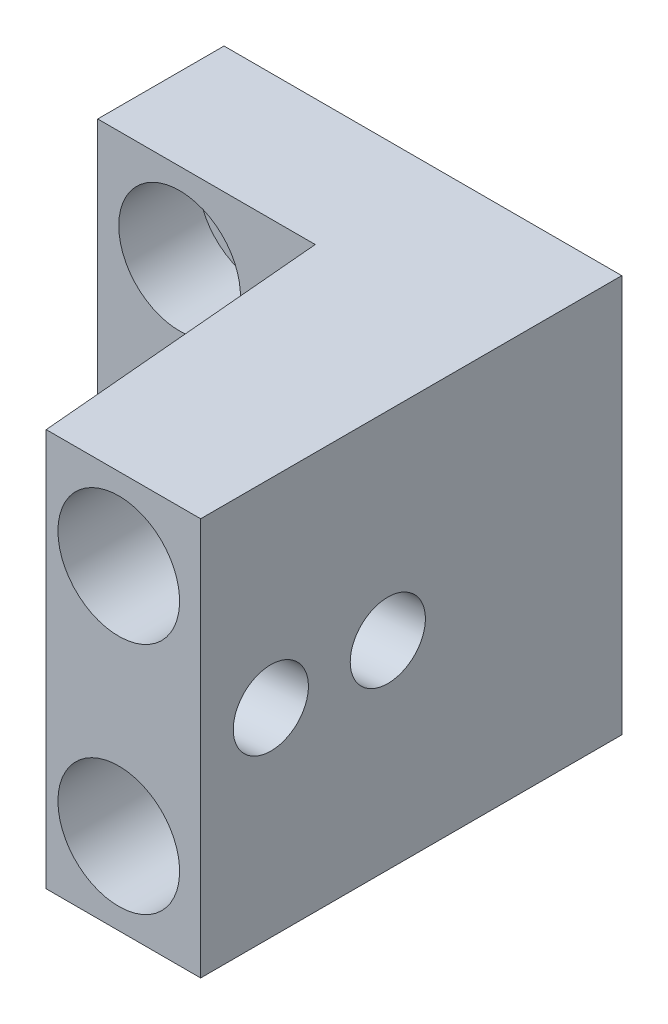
ISO-10303-21;
HEADER;
FILE_DESCRIPTION(('STEP AP214'),'2;1');
FILE_NAME('part.step','',(''),(''),'','','');
FILE_SCHEMA(('AUTOMOTIVE_DESIGN { 1 0 10303 214 1 1 1 1 }'));
ENDSEC;
DATA;
#1=APPLICATION_CONTEXT('core data for automotive mechanical design processes');
#2=APPLICATION_PROTOCOL_DEFINITION('international standard','automotive_design',2000,#1);
#3=PRODUCT_CONTEXT('',#1,'mechanical');
#4=PRODUCT('Part','Part','',(#3));
#5=PRODUCT_RELATED_PRODUCT_CATEGORY('part','',(#4));
#6=PRODUCT_DEFINITION_FORMATION('','',#4);
#7=PRODUCT_DEFINITION_CONTEXT('part definition',#1,'design');
#8=PRODUCT_DEFINITION('design','',#6,#7);
#9=PRODUCT_DEFINITION_SHAPE('','',#8);
#10=(LENGTH_UNIT() NAMED_UNIT(*) SI_UNIT(.MILLI.,.METRE.));
#11=(NAMED_UNIT(*) PLANE_ANGLE_UNIT() SI_UNIT($,.RADIAN.));
#12=(NAMED_UNIT(*) SI_UNIT($,.STERADIAN.) SOLID_ANGLE_UNIT());
#13=UNCERTAINTY_MEASURE_WITH_UNIT(LENGTH_MEASURE(1.E-05),#10,'distance_accuracy_value','');
#14=(GEOMETRIC_REPRESENTATION_CONTEXT(3) GLOBAL_UNCERTAINTY_ASSIGNED_CONTEXT((#13)) GLOBAL_UNIT_ASSIGNED_CONTEXT((#10,
#11,#12)) REPRESENTATION_CONTEXT('',''));
#15=CARTESIAN_POINT('',(0.,0.,0.));
#16=DIRECTION('',(0.,0.,1.));
#17=DIRECTION('',(1.,0.,0.));
#18=AXIS2_PLACEMENT_3D('',#15,#16,#17);
#19=CARTESIAN_POINT('',(-17.5,-17.5,27.));
#20=DIRECTION('',(0.,0.,1.));
#21=DIRECTION('',(-1.,0.,0.));
#22=AXIS2_PLACEMENT_3D('',#19,#20,#21);
#23=PLANE('',#22);
#24=CARTESIAN_POINT('',(0.,50.,27.));
#25=DIRECTION('',(0.,0.,1.));
#26=DIRECTION('',(-1.,0.,0.));
#27=AXIS2_PLACEMENT_3D('',#24,#25,#26);
#28=CIRCLE('',#27,13.);
#29=CARTESIAN_POINT('',(-13.,50.,27.));
#30=VERTEX_POINT('',#29);
#31=EDGE_CURVE('E147',#30,#30,#28,.T.);
#32=ORIENTED_EDGE('',*,*,#31,.F.);
#33=EDGE_LOOP('',(#32));
#34=FACE_BOUND('',#33,.T.);
#35=DIRECTION('',(1.,0.,0.));
#36=VECTOR('',#35,1.);
#37=CARTESIAN_POINT('',(-17.5,-17.5,27.));
#38=LINE('',#37,#36);
#39=CARTESIAN_POINT('',(-17.5,-17.5,27.));
#40=VERTEX_POINT('',#39);
#41=CARTESIAN_POINT('',(28.9882141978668,-17.5,27.));
#42=VERTEX_POINT('',#41);
#43=EDGE_CURVE('E104',#40,#42,#38,.T.);
#44=ORIENTED_EDGE('',*,*,#43,.T.);
#45=DIRECTION('',(0.,1.,0.));
#46=VECTOR('',#45,1.);
#47=CARTESIAN_POINT('',(28.9882141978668,-17.5,27.));
#48=LINE('',#47,#46);
#49=CARTESIAN_POINT('',(28.9882141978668,67.5,27.));
#50=VERTEX_POINT('',#49);
#51=EDGE_CURVE('E75',#42,#50,#48,.T.);
#52=ORIENTED_EDGE('',*,*,#51,.T.);
#53=DIRECTION('',(1.,0.,0.));
#54=VECTOR('',#53,1.);
#55=CARTESIAN_POINT('',(-17.5,67.5,27.));
#56=LINE('',#55,#54);
#57=CARTESIAN_POINT('',(-17.5,67.5,27.));
#58=VERTEX_POINT('',#57);
#59=EDGE_CURVE('E82',#58,#50,#56,.T.);
#60=ORIENTED_EDGE('',*,*,#59,.F.);
#61=DIRECTION('',(0.,1.,0.));
#62=VECTOR('',#61,1.);
#63=CARTESIAN_POINT('',(-17.5,-17.5,27.));
#64=LINE('',#63,#62);
#65=EDGE_CURVE('E65',#40,#58,#64,.T.);
#66=ORIENTED_EDGE('',*,*,#65,.F.);
#67=EDGE_LOOP('',(#44,#52,#60,#66));
#68=FACE_BOUND('',#67,.T.);
#69=CARTESIAN_POINT('',(0.,0.,27.));
#70=DIRECTION('',(0.,0.,1.));
#71=DIRECTION('',(-1.,0.,0.));
#72=AXIS2_PLACEMENT_3D('',#69,#70,#71);
#73=CIRCLE('',#72,13.);
#74=CARTESIAN_POINT('',(-13.,0.,27.));
#75=VERTEX_POINT('',#74);
#76=EDGE_CURVE('E135',#75,#75,#73,.T.);
#77=ORIENTED_EDGE('',*,*,#76,.F.);
#78=EDGE_LOOP('',(#77));
#79=FACE_BOUND('',#78,.T.);
#80=ADVANCED_FACE('F14',(#34,#68,#79),#23,.T.);
#81=CARTESIAN_POINT('',(67.5,-17.5,0.));
#82=DIRECTION('',(0.,0.,-1.));
#83=DIRECTION('',(1.,0.,0.));
#84=AXIS2_PLACEMENT_3D('',#81,#82,#83);
#85=PLANE('',#84);
#86=CARTESIAN_POINT('',(0.,50.,0.));
#87=DIRECTION('',(0.,0.,1.));
#88=DIRECTION('',(-1.,0.,0.));
#89=AXIS2_PLACEMENT_3D('',#86,#87,#88);
#90=CIRCLE('',#89,9.);
#91=CARTESIAN_POINT('',(-9.,50.,0.));
#92=VERTEX_POINT('',#91);
#93=EDGE_CURVE('E138',#92,#92,#90,.T.);
#94=ORIENTED_EDGE('',*,*,#93,.T.);
#95=EDGE_LOOP('',(#94));
#96=FACE_BOUND('',#95,.T.);
#97=CARTESIAN_POINT('',(50.,50.,0.));
#98=DIRECTION('',(0.,0.,1.));
#99=DIRECTION('',(-1.,0.,0.));
#100=AXIS2_PLACEMENT_3D('',#97,#98,#99);
#101=CIRCLE('',#100,9.);
#102=CARTESIAN_POINT('',(41.,50.,0.));
#103=VERTEX_POINT('',#102);
#104=EDGE_CURVE('E86',#103,#103,#101,.T.);
#105=ORIENTED_EDGE('',*,*,#104,.T.);
#106=EDGE_LOOP('',(#105));
#107=FACE_BOUND('',#106,.T.);
#108=DIRECTION('',(0.,1.,0.));
#109=VECTOR('',#108,1.);
#110=CARTESIAN_POINT('',(67.5,-17.5,0.));
#111=LINE('',#110,#109);
#112=CARTESIAN_POINT('',(67.5,-17.5,0.));
#113=VERTEX_POINT('',#112);
#114=CARTESIAN_POINT('',(67.5,67.5,0.));
#115=VERTEX_POINT('',#114);
#116=EDGE_CURVE('E23',#113,#115,#111,.T.);
#117=ORIENTED_EDGE('',*,*,#116,.F.);
#118=DIRECTION('',(-1.,0.,0.));
#119=VECTOR('',#118,1.);
#120=CARTESIAN_POINT('',(67.5,-17.5,0.));
#121=LINE('',#120,#119);
#122=CARTESIAN_POINT('',(-17.5,-17.5,0.));
#123=VERTEX_POINT('',#122);
#124=EDGE_CURVE('E76',#113,#123,#121,.T.);
#125=ORIENTED_EDGE('',*,*,#124,.T.);
#126=DIRECTION('',(0.,1.,0.));
#127=VECTOR('',#126,1.);
#128=CARTESIAN_POINT('',(-17.5,-17.5,0.));
#129=LINE('',#128,#127);
#130=CARTESIAN_POINT('',(-17.5,67.5,0.));
#131=VERTEX_POINT('',#130);
#132=EDGE_CURVE('E9',#123,#131,#129,.T.);
#133=ORIENTED_EDGE('',*,*,#132,.T.);
#134=DIRECTION('',(-1.,0.,0.));
#135=VECTOR('',#134,1.);
#136=CARTESIAN_POINT('',(67.5,67.5,0.));
#137=LINE('',#136,#135);
#138=EDGE_CURVE('E85',#115,#131,#137,.T.);
#139=ORIENTED_EDGE('',*,*,#138,.F.);
#140=EDGE_LOOP('',(#117,#125,#133,#139));
#141=FACE_BOUND('',#140,.T.);
#142=CARTESIAN_POINT('',(50.,0.,0.));
#143=DIRECTION('',(0.,0.,1.));
#144=DIRECTION('',(-1.,0.,0.));
#145=AXIS2_PLACEMENT_3D('',#142,#143,#144);
#146=CIRCLE('',#145,9.);
#147=CARTESIAN_POINT('',(41.,0.,0.));
#148=VERTEX_POINT('',#147);
#149=EDGE_CURVE('E159',#148,#148,#146,.T.);
#150=ORIENTED_EDGE('',*,*,#149,.T.);
#151=EDGE_LOOP('',(#150));
#152=FACE_BOUND('',#151,.T.);
#153=CARTESIAN_POINT('',(0.,0.,0.));
#154=DIRECTION('',(0.,0.,1.));
#155=DIRECTION('',(-1.,0.,0.));
#156=AXIS2_PLACEMENT_3D('',#153,#154,#155);
#157=CIRCLE('',#156,9.);
#158=CARTESIAN_POINT('',(-9.,0.,0.));
#159=VERTEX_POINT('',#158);
#160=EDGE_CURVE('E119',#159,#159,#157,.T.);
#161=ORIENTED_EDGE('',*,*,#160,.T.);
#162=EDGE_LOOP('',(#161));
#163=FACE_BOUND('',#162,.T.);
#164=ADVANCED_FACE('F16',(#96,#107,#141,#152,#163),#85,.T.);
#165=CARTESIAN_POINT('',(34.5,-17.5,90.));
#166=DIRECTION('',(0.,0.,1.));
#167=DIRECTION('',(-1.,0.,0.));
#168=AXIS2_PLACEMENT_3D('',#165,#166,#167);
#169=PLANE('',#168);
#170=CARTESIAN_POINT('',(50.,50.,90.));
#171=DIRECTION('',(0.,0.,1.));
#172=DIRECTION('',(-1.,0.,0.));
#173=AXIS2_PLACEMENT_3D('',#170,#171,#172);
#174=CIRCLE('',#173,13.);
#175=CARTESIAN_POINT('',(37.,50.,90.));
#176=VERTEX_POINT('',#175);
#177=EDGE_CURVE('E162',#176,#176,#174,.T.);
#178=ORIENTED_EDGE('',*,*,#177,.F.);
#179=EDGE_LOOP('',(#178));
#180=FACE_BOUND('',#179,.T.);
#181=DIRECTION('',(0.,1.,0.));
#182=VECTOR('',#181,1.);
#183=CARTESIAN_POINT('',(34.5,-17.5,90.));
#184=LINE('',#183,#182);
#185=CARTESIAN_POINT('',(34.5,-17.5,90.));
#186=VERTEX_POINT('',#185);
#187=CARTESIAN_POINT('',(34.5,67.5,90.));
#188=VERTEX_POINT('',#187);
#189=EDGE_CURVE('E108',#186,#188,#184,.T.);
#190=ORIENTED_EDGE('',*,*,#189,.F.);
#191=DIRECTION('',(1.,0.,0.));
#192=VECTOR('',#191,1.);
#193=CARTESIAN_POINT('',(34.5,-17.5,90.));
#194=LINE('',#193,#192);
#195=CARTESIAN_POINT('',(67.5,-17.5,90.));
#196=VERTEX_POINT('',#195);
#197=EDGE_CURVE('E98',#186,#196,#194,.T.);
#198=ORIENTED_EDGE('',*,*,#197,.T.);
#199=DIRECTION('',(0.,1.,0.));
#200=VECTOR('',#199,1.);
#201=CARTESIAN_POINT('',(67.5,-17.5,90.));
#202=LINE('',#201,#200);
#203=CARTESIAN_POINT('',(67.5,67.5,90.));
#204=VERTEX_POINT('',#203);
#205=EDGE_CURVE('E110',#196,#204,#202,.T.);
#206=ORIENTED_EDGE('',*,*,#205,.T.);
#207=DIRECTION('',(1.,0.,0.));
#208=VECTOR('',#207,1.);
#209=CARTESIAN_POINT('',(34.5,67.5,90.));
#210=LINE('',#209,#208);
#211=EDGE_CURVE('E91',#188,#204,#210,.T.);
#212=ORIENTED_EDGE('',*,*,#211,.F.);
#213=EDGE_LOOP('',(#190,#198,#206,#212));
#214=FACE_BOUND('',#213,.T.);
#215=CARTESIAN_POINT('',(50.,0.,90.));
#216=DIRECTION('',(0.,0.,1.));
#217=DIRECTION('',(-1.,0.,0.));
#218=AXIS2_PLACEMENT_3D('',#215,#216,#217);
#219=CIRCLE('',#218,13.);
#220=CARTESIAN_POINT('',(37.,0.,90.));
#221=VERTEX_POINT('',#220);
#222=EDGE_CURVE('E150',#221,#221,#219,.T.);
#223=ORIENTED_EDGE('',*,*,#222,.F.);
#224=EDGE_LOOP('',(#223));
#225=FACE_BOUND('',#224,.T.);
#226=ADVANCED_FACE('F188',(#180,#214,#225),#169,.T.);
#227=CARTESIAN_POINT('',(-17.5,67.5,0.));
#228=DIRECTION('',(0.,-1.,0.));
#229=DIRECTION('',(0.,0.,1.));
#230=AXIS2_PLACEMENT_3D('',#227,#228,#229);
#231=PLANE('',#230);
#232=DIRECTION('',(0.,0.,1.));
#233=VECTOR('',#232,1.);
#234=CARTESIAN_POINT('',(-17.5,67.5,0.));
#235=LINE('',#234,#233);
#236=EDGE_CURVE('E68',#131,#58,#235,.T.);
#237=ORIENTED_EDGE('',*,*,#236,.T.);
#238=ORIENTED_EDGE('',*,*,#59,.T.);
#239=DIRECTION('',(-0.0871557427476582,0.,-0.996194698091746));
#240=VECTOR('',#239,1.);
#241=CARTESIAN_POINT('',(34.5,67.5,90.));
#242=LINE('',#241,#240);
#243=EDGE_CURVE('E89',#188,#50,#242,.T.);
#244=ORIENTED_EDGE('',*,*,#243,.F.);
#245=ORIENTED_EDGE('',*,*,#211,.T.);
#246=DIRECTION('',(0.,0.,-1.));
#247=VECTOR('',#246,1.);
#248=CARTESIAN_POINT('',(67.5,67.5,90.));
#249=LINE('',#248,#247);
#250=EDGE_CURVE('E174',#204,#115,#249,.T.);
#251=ORIENTED_EDGE('',*,*,#250,.T.);
#252=ORIENTED_EDGE('',*,*,#138,.T.);
#253=EDGE_LOOP('',(#237,#238,#244,#245,#251,#252));
#254=FACE_BOUND('',#253,.T.);
#255=ADVANCED_FACE('F80',(#254),#231,.F.);
#256=CARTESIAN_POINT('',(-17.5,-17.5,0.));
#257=DIRECTION('',(-1.,0.,0.));
#258=DIRECTION('',(0.,0.,-1.));
#259=AXIS2_PLACEMENT_3D('',#256,#257,#258);
#260=PLANE('',#259);
#261=ORIENTED_EDGE('',*,*,#132,.F.);
#262=DIRECTION('',(0.,0.,1.));
#263=VECTOR('',#262,1.);
#264=CARTESIAN_POINT('',(-17.5,-17.5,0.));
#265=LINE('',#264,#263);
#266=EDGE_CURVE('E70',#123,#40,#265,.T.);
#267=ORIENTED_EDGE('',*,*,#266,.T.);
#268=ORIENTED_EDGE('',*,*,#65,.T.);
#269=ORIENTED_EDGE('',*,*,#236,.F.);
#270=EDGE_LOOP('',(#261,#267,#268,#269));
#271=FACE_BOUND('',#270,.T.);
#272=ADVANCED_FACE('F67',(#271),#260,.T.);
#273=CARTESIAN_POINT('',(67.5,-17.5,90.));
#274=DIRECTION('',(1.,0.,0.));
#275=DIRECTION('',(0.,0.,1.));
#276=AXIS2_PLACEMENT_3D('',#273,#274,#275);
#277=PLANE('',#276);
#278=CARTESIAN_POINT('',(67.5,25.,50.));
#279=DIRECTION('',(1.,0.,0.));
#280=DIRECTION('',(0.,0.,1.));
#281=AXIS2_PLACEMENT_3D('',#278,#279,#280);
#282=ELLIPSE('',#281,8.03055870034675,8.);
#283=CARTESIAN_POINT('',(67.5,25.,58.0305587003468));
#284=VERTEX_POINT('',#283);
#285=EDGE_CURVE('E115',#284,#284,#282,.T.);
#286=ORIENTED_EDGE('',*,*,#285,.F.);
#287=EDGE_LOOP('',(#286));
#288=FACE_BOUND('',#287,.T.);
#289=CARTESIAN_POINT('',(67.5,25.,75.));
#290=DIRECTION('',(1.,0.,0.));
#291=DIRECTION('',(0.,0.,1.));
#292=AXIS2_PLACEMENT_3D('',#289,#290,#291);
#293=ELLIPSE('',#292,8.03055870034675,8.);
#294=CARTESIAN_POINT('',(67.5,25.,83.0305587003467));
#295=VERTEX_POINT('',#294);
#296=EDGE_CURVE('E114',#295,#295,#293,.T.);
#297=ORIENTED_EDGE('',*,*,#296,.F.);
#298=EDGE_LOOP('',(#297));
#299=FACE_BOUND('',#298,.T.);
#300=ORIENTED_EDGE('',*,*,#205,.F.);
#301=DIRECTION('',(0.,0.,-1.));
#302=VECTOR('',#301,1.);
#303=CARTESIAN_POINT('',(67.5,-17.5,90.));
#304=LINE('',#303,#302);
#305=EDGE_CURVE('E96',#196,#113,#304,.T.);
#306=ORIENTED_EDGE('',*,*,#305,.T.);
#307=ORIENTED_EDGE('',*,*,#116,.T.);
#308=ORIENTED_EDGE('',*,*,#250,.F.);
#309=EDGE_LOOP('',(#300,#306,#307,#308));
#310=FACE_BOUND('',#309,.T.);
#311=ADVANCED_FACE('F180',(#288,#299,#310),#277,.T.);
#312=CARTESIAN_POINT('',(34.5,-17.5,90.));
#313=DIRECTION('',(0.996194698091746,0.,-0.0871557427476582));
#314=DIRECTION('',(0.0871557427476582,0.,0.996194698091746));
#315=AXIS2_PLACEMENT_3D('',#312,#313,#314);
#316=PLANE('',#315);
#317=CARTESIAN_POINT('',(31.2777085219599,25.,53.1690398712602));
#318=DIRECTION('',(0.996194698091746,0.,-0.0871557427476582));
#319=DIRECTION('',(0.0871557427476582,0.,0.996194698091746));
#320=AXIS2_PLACEMENT_3D('',#317,#318,#319);
#321=CIRCLE('',#320,8.);
#322=CARTESIAN_POINT('',(31.9749544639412,25.,61.1385974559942));
#323=VERTEX_POINT('',#322);
#324=EDGE_CURVE('E18',#323,#323,#321,.T.);
#325=ORIENTED_EDGE('',*,*,#324,.T.);
#326=EDGE_LOOP('',(#325));
#327=FACE_BOUND('',#326,.T.);
#328=CARTESIAN_POINT('',(33.4483107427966,25.,77.9791367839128));
#329=DIRECTION('',(0.996194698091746,0.,-0.0871557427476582));
#330=DIRECTION('',(0.0871557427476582,0.,0.996194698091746));
#331=AXIS2_PLACEMENT_3D('',#328,#329,#330);
#332=CIRCLE('',#331,8.);
#333=CARTESIAN_POINT('',(34.1455566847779,25.,85.9486943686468));
#334=VERTEX_POINT('',#333);
#335=EDGE_CURVE('E112',#334,#334,#332,.T.);
#336=ORIENTED_EDGE('',*,*,#335,.T.);
#337=EDGE_LOOP('',(#336));
#338=FACE_BOUND('',#337,.T.);
#339=ORIENTED_EDGE('',*,*,#51,.F.);
#340=DIRECTION('',(-0.0871557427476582,0.,-0.996194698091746));
#341=VECTOR('',#340,1.);
#342=CARTESIAN_POINT('',(34.5,-17.5,90.));
#343=LINE('',#342,#341);
#344=EDGE_CURVE('E101',#186,#42,#343,.T.);
#345=ORIENTED_EDGE('',*,*,#344,.F.);
#346=ORIENTED_EDGE('',*,*,#189,.T.);
#347=ORIENTED_EDGE('',*,*,#243,.T.);
#348=EDGE_LOOP('',(#339,#345,#346,#347));
#349=FACE_BOUND('',#348,.T.);
#350=ADVANCED_FACE('F222',(#327,#338,#349),#316,.F.);
#351=CARTESIAN_POINT('',(-17.5,-17.5,0.));
#352=DIRECTION('',(0.,-1.,0.));
#353=DIRECTION('',(0.,0.,1.));
#354=AXIS2_PLACEMENT_3D('',#351,#352,#353);
#355=PLANE('',#354);
#356=ORIENTED_EDGE('',*,*,#266,.F.);
#357=ORIENTED_EDGE('',*,*,#124,.F.);
#358=ORIENTED_EDGE('',*,*,#305,.F.);
#359=ORIENTED_EDGE('',*,*,#197,.F.);
#360=ORIENTED_EDGE('',*,*,#344,.T.);
#361=ORIENTED_EDGE('',*,*,#43,.F.);
#362=EDGE_LOOP('',(#356,#357,#358,#359,#360,#361));
#363=FACE_BOUND('',#362,.T.);
#364=ADVANCED_FACE('F185',(#363),#355,.T.);
#365=CARTESIAN_POINT('',(50.,50.,90.));
#366=DIRECTION('',(0.,0.,1.));
#367=DIRECTION('',(-1.,0.,0.));
#368=AXIS2_PLACEMENT_3D('',#365,#366,#367);
#369=CYLINDRICAL_SURFACE('',#368,9.);
#370=CARTESIAN_POINT('',(50.,50.,33.));
#371=DIRECTION('',(0.,0.,1.));
#372=DIRECTION('',(-1.,0.,0.));
#373=AXIS2_PLACEMENT_3D('',#370,#371,#372);
#374=CIRCLE('',#373,9.);
#375=CARTESIAN_POINT('',(41.,50.,33.));
#376=VERTEX_POINT('',#375);
#377=EDGE_CURVE('E168',#376,#376,#374,.T.);
#378=ORIENTED_EDGE('',*,*,#377,.T.);
#379=EDGE_LOOP('',(#378));
#380=FACE_BOUND('',#379,.T.);
#381=ORIENTED_EDGE('',*,*,#104,.F.);
#382=EDGE_LOOP('',(#381));
#383=FACE_BOUND('',#382,.T.);
#384=ADVANCED_FACE('F246',(#380,#383),#369,.F.);
#385=CARTESIAN_POINT('',(41.,50.,33.));
#386=DIRECTION('',(0.,0.,1.));
#387=DIRECTION('',(-1.,0.,0.));
#388=AXIS2_PLACEMENT_3D('',#385,#386,#387);
#389=PLANE('',#388);
#390=CARTESIAN_POINT('',(50.,50.,33.));
#391=DIRECTION('',(0.,0.,1.));
#392=DIRECTION('',(-1.,0.,0.));
#393=AXIS2_PLACEMENT_3D('',#390,#391,#392);
#394=CIRCLE('',#393,13.);
#395=CARTESIAN_POINT('',(37.,50.,33.));
#396=VERTEX_POINT('',#395);
#397=EDGE_CURVE('E165',#396,#396,#394,.T.);
#398=ORIENTED_EDGE('',*,*,#397,.T.);
#399=EDGE_LOOP('',(#398));
#400=FACE_BOUND('',#399,.T.);
#401=ORIENTED_EDGE('',*,*,#377,.F.);
#402=EDGE_LOOP('',(#401));
#403=FACE_BOUND('',#402,.T.);
#404=ADVANCED_FACE('F253',(#400,#403),#389,.T.);
#405=CARTESIAN_POINT('',(50.,50.,90.));
#406=DIRECTION('',(0.,0.,1.));
#407=DIRECTION('',(-1.,0.,0.));
#408=AXIS2_PLACEMENT_3D('',#405,#406,#407);
#409=CYLINDRICAL_SURFACE('',#408,13.);
#410=ORIENTED_EDGE('',*,*,#177,.T.);
#411=EDGE_LOOP('',(#410));
#412=FACE_BOUND('',#411,.T.);
#413=ORIENTED_EDGE('',*,*,#397,.F.);
#414=EDGE_LOOP('',(#413));
#415=FACE_BOUND('',#414,.T.);
#416=ADVANCED_FACE('F259',(#412,#415),#409,.F.);
#417=CARTESIAN_POINT('',(50.,0.,90.));
#418=DIRECTION('',(0.,0.,1.));
#419=DIRECTION('',(-1.,0.,0.));
#420=AXIS2_PLACEMENT_3D('',#417,#418,#419);
#421=CYLINDRICAL_SURFACE('',#420,9.);
#422=CARTESIAN_POINT('',(50.,0.,33.));
#423=DIRECTION('',(0.,0.,1.));
#424=DIRECTION('',(-1.,0.,0.));
#425=AXIS2_PLACEMENT_3D('',#422,#423,#424);
#426=CIRCLE('',#425,9.);
#427=CARTESIAN_POINT('',(41.,0.,33.));
#428=VERTEX_POINT('',#427);
#429=EDGE_CURVE('E156',#428,#428,#426,.T.);
#430=ORIENTED_EDGE('',*,*,#429,.T.);
#431=EDGE_LOOP('',(#430));
#432=FACE_BOUND('',#431,.T.);
#433=ORIENTED_EDGE('',*,*,#149,.F.);
#434=EDGE_LOOP('',(#433));
#435=FACE_BOUND('',#434,.T.);
#436=ADVANCED_FACE('F270',(#432,#435),#421,.F.);
#437=CARTESIAN_POINT('',(41.,0.,33.));
#438=DIRECTION('',(0.,0.,1.));
#439=DIRECTION('',(-1.,0.,0.));
#440=AXIS2_PLACEMENT_3D('',#437,#438,#439);
#441=PLANE('',#440);
#442=CARTESIAN_POINT('',(50.,0.,33.));
#443=DIRECTION('',(0.,0.,1.));
#444=DIRECTION('',(-1.,0.,0.));
#445=AXIS2_PLACEMENT_3D('',#442,#443,#444);
#446=CIRCLE('',#445,13.);
#447=CARTESIAN_POINT('',(37.,0.,33.));
#448=VERTEX_POINT('',#447);
#449=EDGE_CURVE('E153',#448,#448,#446,.T.);
#450=ORIENTED_EDGE('',*,*,#449,.T.);
#451=EDGE_LOOP('',(#450));
#452=FACE_BOUND('',#451,.T.);
#453=ORIENTED_EDGE('',*,*,#429,.F.);
#454=EDGE_LOOP('',(#453));
#455=FACE_BOUND('',#454,.T.);
#456=ADVANCED_FACE('F276',(#452,#455),#441,.T.);
#457=CARTESIAN_POINT('',(50.,0.,90.));
#458=DIRECTION('',(0.,0.,1.));
#459=DIRECTION('',(-1.,0.,0.));
#460=AXIS2_PLACEMENT_3D('',#457,#458,#459);
#461=CYLINDRICAL_SURFACE('',#460,13.);
#462=ORIENTED_EDGE('',*,*,#222,.T.);
#463=EDGE_LOOP('',(#462));
#464=FACE_BOUND('',#463,.T.);
#465=ORIENTED_EDGE('',*,*,#449,.F.);
#466=EDGE_LOOP('',(#465));
#467=FACE_BOUND('',#466,.T.);
#468=ADVANCED_FACE('F280',(#464,#467),#461,.F.);
#469=CARTESIAN_POINT('',(0.,50.,27.));
#470=DIRECTION('',(0.,0.,1.));
#471=DIRECTION('',(-1.,0.,0.));
#472=AXIS2_PLACEMENT_3D('',#469,#470,#471);
#473=CYLINDRICAL_SURFACE('',#472,13.);
#474=ORIENTED_EDGE('',*,*,#31,.T.);
#475=EDGE_LOOP('',(#474));
#476=FACE_BOUND('',#475,.T.);
#477=CARTESIAN_POINT('',(0.,50.,10.));
#478=DIRECTION('',(0.,0.,1.));
#479=DIRECTION('',(-1.,0.,0.));
#480=AXIS2_PLACEMENT_3D('',#477,#478,#479);
#481=CIRCLE('',#480,13.);
#482=CARTESIAN_POINT('',(-13.,50.,10.));
#483=VERTEX_POINT('',#482);
#484=EDGE_CURVE('E144',#483,#483,#481,.T.);
#485=ORIENTED_EDGE('',*,*,#484,.F.);
#486=EDGE_LOOP('',(#485));
#487=FACE_BOUND('',#486,.T.);
#488=ADVANCED_FACE('F284',(#476,#487),#473,.F.);
#489=CARTESIAN_POINT('',(-9.,50.,10.));
#490=DIRECTION('',(0.,0.,1.));
#491=DIRECTION('',(-1.,0.,0.));
#492=AXIS2_PLACEMENT_3D('',#489,#490,#491);
#493=PLANE('',#492);
#494=ORIENTED_EDGE('',*,*,#484,.T.);
#495=EDGE_LOOP('',(#494));
#496=FACE_BOUND('',#495,.T.);
#497=CARTESIAN_POINT('',(0.,50.,10.));
#498=DIRECTION('',(0.,0.,1.));
#499=DIRECTION('',(-1.,0.,0.));
#500=AXIS2_PLACEMENT_3D('',#497,#498,#499);
#501=CIRCLE('',#500,9.);
#502=CARTESIAN_POINT('',(-9.,50.,10.));
#503=VERTEX_POINT('',#502);
#504=EDGE_CURVE('E141',#503,#503,#501,.T.);
#505=ORIENTED_EDGE('',*,*,#504,.F.);
#506=EDGE_LOOP('',(#505));
#507=FACE_BOUND('',#506,.T.);
#508=ADVANCED_FACE('F288',(#496,#507),#493,.T.);
#509=CARTESIAN_POINT('',(0.,50.,27.));
#510=DIRECTION('',(0.,0.,1.));
#511=DIRECTION('',(-1.,0.,0.));
#512=AXIS2_PLACEMENT_3D('',#509,#510,#511);
#513=CYLINDRICAL_SURFACE('',#512,9.);
#514=ORIENTED_EDGE('',*,*,#504,.T.);
#515=EDGE_LOOP('',(#514));
#516=FACE_BOUND('',#515,.T.);
#517=ORIENTED_EDGE('',*,*,#93,.F.);
#518=EDGE_LOOP('',(#517));
#519=FACE_BOUND('',#518,.T.);
#520=ADVANCED_FACE('F292',(#516,#519),#513,.F.);
#521=CARTESIAN_POINT('',(0.,0.,27.));
#522=DIRECTION('',(0.,0.,1.));
#523=DIRECTION('',(-1.,0.,0.));
#524=AXIS2_PLACEMENT_3D('',#521,#522,#523);
#525=CYLINDRICAL_SURFACE('',#524,13.);
#526=ORIENTED_EDGE('',*,*,#76,.T.);
#527=EDGE_LOOP('',(#526));
#528=FACE_BOUND('',#527,.T.);
#529=CARTESIAN_POINT('',(0.,0.,10.));
#530=DIRECTION('',(0.,0.,1.));
#531=DIRECTION('',(-1.,0.,0.));
#532=AXIS2_PLACEMENT_3D('',#529,#530,#531);
#533=CIRCLE('',#532,13.);
#534=CARTESIAN_POINT('',(-13.,0.,10.));
#535=VERTEX_POINT('',#534);
#536=EDGE_CURVE('E132',#535,#535,#533,.T.);
#537=ORIENTED_EDGE('',*,*,#536,.F.);
#538=EDGE_LOOP('',(#537));
#539=FACE_BOUND('',#538,.T.);
#540=ADVANCED_FACE('F209',(#528,#539),#525,.F.);
#541=CARTESIAN_POINT('',(-9.,0.,10.));
#542=DIRECTION('',(0.,0.,1.));
#543=DIRECTION('',(-1.,0.,0.));
#544=AXIS2_PLACEMENT_3D('',#541,#542,#543);
#545=PLANE('',#544);
#546=ORIENTED_EDGE('',*,*,#536,.T.);
#547=EDGE_LOOP('',(#546));
#548=FACE_BOUND('',#547,.T.);
#549=CARTESIAN_POINT('',(0.,0.,10.));
#550=DIRECTION('',(0.,0.,1.));
#551=DIRECTION('',(-1.,0.,0.));
#552=AXIS2_PLACEMENT_3D('',#549,#550,#551);
#553=CIRCLE('',#552,9.);
#554=CARTESIAN_POINT('',(-9.,0.,10.));
#555=VERTEX_POINT('',#554);
#556=EDGE_CURVE('E129',#555,#555,#553,.T.);
#557=ORIENTED_EDGE('',*,*,#556,.F.);
#558=EDGE_LOOP('',(#557));
#559=FACE_BOUND('',#558,.T.);
#560=ADVANCED_FACE('F197',(#548,#559),#545,.T.);
#561=CARTESIAN_POINT('',(0.,0.,27.));
#562=DIRECTION('',(0.,0.,1.));
#563=DIRECTION('',(-1.,0.,0.));
#564=AXIS2_PLACEMENT_3D('',#561,#562,#563);
#565=CYLINDRICAL_SURFACE('',#564,9.);
#566=ORIENTED_EDGE('',*,*,#556,.T.);
#567=EDGE_LOOP('',(#566));
#568=FACE_BOUND('',#567,.T.);
#569=ORIENTED_EDGE('',*,*,#160,.F.);
#570=EDGE_LOOP('',(#569));
#571=FACE_BOUND('',#570,.T.);
#572=ADVANCED_FACE('F194',(#568,#571),#565,.F.);
#573=CARTESIAN_POINT('',(35.1680429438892,25.,77.8286797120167));
#574=DIRECTION('',(-0.996194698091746,0.,0.0871557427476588));
#575=DIRECTION('',(-0.0871557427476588,0.,-0.996194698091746));
#576=AXIS2_PLACEMENT_3D('',#573,#574,#575);
#577=CYLINDRICAL_SURFACE('',#576,8.);
#578=ORIENTED_EDGE('',*,*,#296,.T.);
#579=EDGE_LOOP('',(#578));
#580=FACE_BOUND('',#579,.T.);
#581=ORIENTED_EDGE('',*,*,#335,.F.);
#582=EDGE_LOOP('',(#581));
#583=FACE_BOUND('',#582,.T.);
#584=ADVANCED_FACE('F196',(#580,#583),#577,.F.);
#585=CARTESIAN_POINT('',(35.1680429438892,25.,52.8286797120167));
#586=DIRECTION('',(-0.996194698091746,0.,0.0871557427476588));
#587=DIRECTION('',(-0.0871557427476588,0.,-0.996194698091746));
#588=AXIS2_PLACEMENT_3D('',#585,#586,#587);
#589=CYLINDRICAL_SURFACE('',#588,8.);
#590=ORIENTED_EDGE('',*,*,#285,.T.);
#591=EDGE_LOOP('',(#590));
#592=FACE_BOUND('',#591,.T.);
#593=ORIENTED_EDGE('',*,*,#324,.F.);
#594=EDGE_LOOP('',(#593));
#595=FACE_BOUND('',#594,.T.);
#596=ADVANCED_FACE('F206',(#592,#595),#589,.F.);
#597=CLOSED_SHELL('',(#80,#164,#226,#255,#272,#311,#350,#364,#384,#404,#416,#436,#456,#468,#488,
#508,#520,#540,#560,#572,#584,#596));
#598=MANIFOLD_SOLID_BREP('B1',#597);
#599=ADVANCED_BREP_SHAPE_REPRESENTATION('',(#18,#598),#14);
#600=SHAPE_DEFINITION_REPRESENTATION(#9,#599);
ENDSEC;
END-ISO-10303-21;
